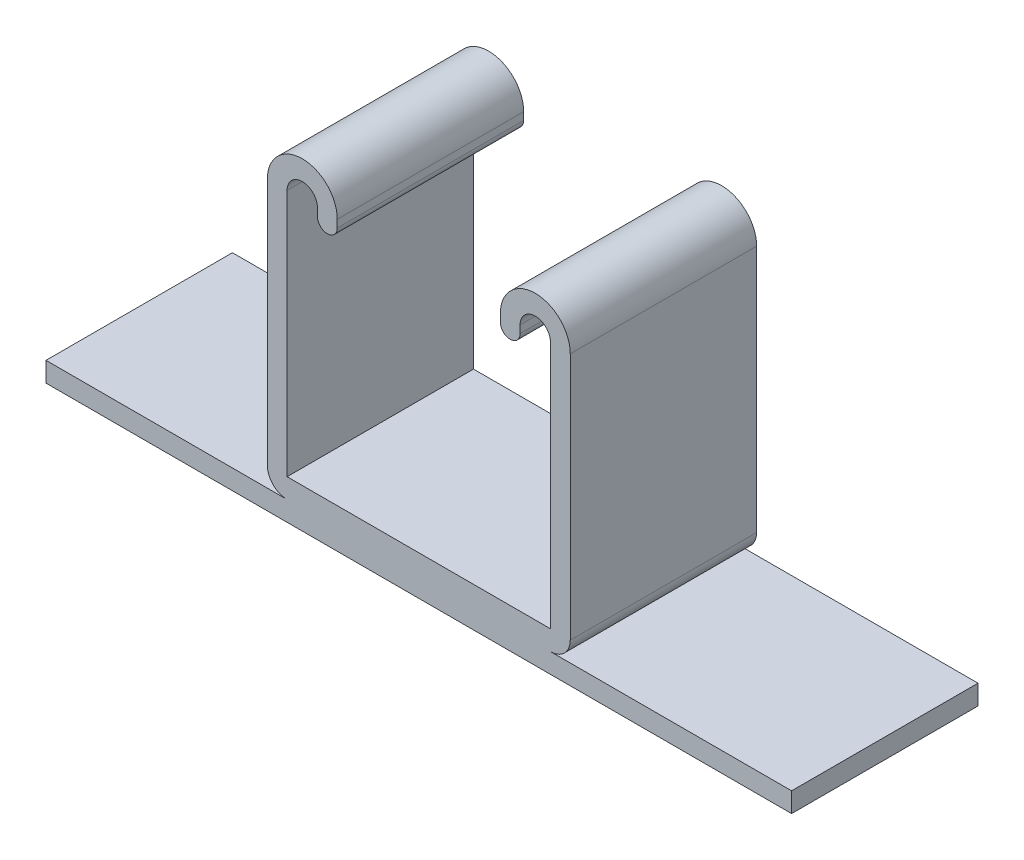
ISO-10303-21;
HEADER;
FILE_DESCRIPTION(('STEP AP214'),'2;1');
FILE_NAME('part.step','',(''),(''),'','','');
FILE_SCHEMA(('AUTOMOTIVE_DESIGN { 1 0 10303 214 1 1 1 1 }'));
ENDSEC;
DATA;
#1=APPLICATION_CONTEXT('core data for automotive mechanical design processes');
#2=APPLICATION_PROTOCOL_DEFINITION('international standard','automotive_design',2000,#1);
#3=PRODUCT_CONTEXT('',#1,'mechanical');
#4=PRODUCT('Part','Part','',(#3));
#5=PRODUCT_RELATED_PRODUCT_CATEGORY('part','',(#4));
#6=PRODUCT_DEFINITION_FORMATION('','',#4);
#7=PRODUCT_DEFINITION_CONTEXT('part definition',#1,'design');
#8=PRODUCT_DEFINITION('design','',#6,#7);
#9=PRODUCT_DEFINITION_SHAPE('','',#8);
#10=(LENGTH_UNIT() NAMED_UNIT(*) SI_UNIT(.MILLI.,.METRE.));
#11=(NAMED_UNIT(*) PLANE_ANGLE_UNIT() SI_UNIT($,.RADIAN.));
#12=(NAMED_UNIT(*) SI_UNIT($,.STERADIAN.) SOLID_ANGLE_UNIT());
#13=UNCERTAINTY_MEASURE_WITH_UNIT(LENGTH_MEASURE(1.E-05),#10,'distance_accuracy_value','');
#14=(GEOMETRIC_REPRESENTATION_CONTEXT(3) GLOBAL_UNCERTAINTY_ASSIGNED_CONTEXT((#13)) GLOBAL_UNIT_ASSIGNED_CONTEXT((#10,
#11,#12)) REPRESENTATION_CONTEXT('',''));
#15=CARTESIAN_POINT('',(0.,0.,0.));
#16=DIRECTION('',(0.,0.,1.));
#17=DIRECTION('',(1.,0.,0.));
#18=AXIS2_PLACEMENT_3D('',#15,#16,#17);
#19=CARTESIAN_POINT('',(-15.875,26.8351,12.7));
#20=DIRECTION('',(0.,0.,-1.));
#21=DIRECTION('',(-1.,0.,0.));
#22=AXIS2_PLACEMENT_3D('',#19,#20,#21);
#23=CYLINDRICAL_SURFACE('',#22,4.7625);
#24=CARTESIAN_POINT('',(-15.875,26.8351,-12.7));
#25=DIRECTION('',(0.,0.,1.));
#26=DIRECTION('',(-1.,0.,0.));
#27=AXIS2_PLACEMENT_3D('',#24,#25,#26);
#28=CIRCLE('',#27,4.7625);
#29=CARTESIAN_POINT('',(-11.1125,26.8351,-12.7));
#30=VERTEX_POINT('',#29);
#31=CARTESIAN_POINT('',(-20.6375,26.8351,-12.7));
#32=VERTEX_POINT('',#31);
#33=EDGE_CURVE('E219',#30,#32,#28,.T.);
#34=ORIENTED_EDGE('',*,*,#33,.T.);
#35=DIRECTION('',(0.,0.,-1.));
#36=VECTOR('',#35,1.);
#37=CARTESIAN_POINT('',(-20.6375,26.8351,12.7));
#38=LINE('',#37,#36);
#39=CARTESIAN_POINT('',(-20.6375,26.8351,12.7));
#40=VERTEX_POINT('',#39);
#41=EDGE_CURVE('E11',#40,#32,#38,.T.);
#42=ORIENTED_EDGE('',*,*,#41,.F.);
#43=CARTESIAN_POINT('',(-15.875,26.8351,12.7));
#44=DIRECTION('',(0.,0.,1.));
#45=DIRECTION('',(-1.,0.,0.));
#46=AXIS2_PLACEMENT_3D('',#43,#44,#45);
#47=CIRCLE('',#46,4.7625);
#48=CARTESIAN_POINT('',(-11.1125,26.8351,12.7));
#49=VERTEX_POINT('',#48);
#50=EDGE_CURVE('E261',#49,#40,#47,.T.);
#51=ORIENTED_EDGE('',*,*,#50,.F.);
#52=DIRECTION('',(0.,0.,-1.));
#53=VECTOR('',#52,1.);
#54=CARTESIAN_POINT('',(-11.1125,26.8351,12.7));
#55=LINE('',#54,#53);
#56=EDGE_CURVE('E215',#49,#30,#55,.T.);
#57=ORIENTED_EDGE('',*,*,#56,.T.);
#58=EDGE_LOOP('',(#34,#42,#51,#57));
#59=FACE_BOUND('',#58,.T.);
#60=ADVANCED_FACE('F39',(#59),#23,.T.);
#61=CARTESIAN_POINT('',(-20.6375,26.8351,12.7));
#62=DIRECTION('',(1.,0.,0.));
#63=DIRECTION('',(0.,0.,-1.));
#64=AXIS2_PLACEMENT_3D('',#61,#62,#63);
#65=PLANE('',#64);
#66=DIRECTION('',(0.,-1.,0.));
#67=VECTOR('',#66,1.);
#68=CARTESIAN_POINT('',(-20.6375,26.8351,-12.7));
#69=LINE('',#68,#67);
#70=CARTESIAN_POINT('',(-20.6375,-6.95960000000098,-12.7));
#71=VERTEX_POINT('',#70);
#72=EDGE_CURVE('E222',#32,#71,#69,.T.);
#73=ORIENTED_EDGE('',*,*,#72,.T.);
#74=DIRECTION('',(0.,0.,-1.));
#75=VECTOR('',#74,1.);
#76=CARTESIAN_POINT('',(-20.6375,-6.95960000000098,12.7));
#77=LINE('',#76,#75);
#78=CARTESIAN_POINT('',(-20.6375,-6.95960000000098,12.7));
#79=VERTEX_POINT('',#78);
#80=EDGE_CURVE('E47',#79,#71,#77,.T.);
#81=ORIENTED_EDGE('',*,*,#80,.F.);
#82=DIRECTION('',(0.,-1.,0.));
#83=VECTOR('',#82,1.);
#84=CARTESIAN_POINT('',(-20.6375,26.8351,12.7));
#85=LINE('',#84,#83);
#86=EDGE_CURVE('E140',#40,#79,#85,.T.);
#87=ORIENTED_EDGE('',*,*,#86,.F.);
#88=ORIENTED_EDGE('',*,*,#41,.T.);
#89=EDGE_LOOP('',(#73,#81,#87,#88));
#90=FACE_BOUND('',#89,.T.);
#91=ADVANCED_FACE('F389',(#90),#65,.F.);
#92=CARTESIAN_POINT('',(-17.9451,-6.95960000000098,12.7));
#93=DIRECTION('',(0.,0.,-1.));
#94=DIRECTION('',(-1.,0.,0.));
#95=AXIS2_PLACEMENT_3D('',#92,#93,#94);
#96=CYLINDRICAL_SURFACE('',#95,2.69239999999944);
#97=CARTESIAN_POINT('',(-17.9451,-6.95960000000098,-12.7));
#98=DIRECTION('',(0.,0.,1.));
#99=DIRECTION('',(-1.,0.,0.));
#100=AXIS2_PLACEMENT_3D('',#97,#98,#99);
#101=CIRCLE('',#100,2.69239999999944);
#102=CARTESIAN_POINT('',(-17.9451,-9.65200000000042,-12.7));
#103=VERTEX_POINT('',#102);
#104=EDGE_CURVE('E224',#71,#103,#101,.T.);
#105=ORIENTED_EDGE('',*,*,#104,.T.);
#106=DIRECTION('',(0.,0.,-1.));
#107=VECTOR('',#106,1.);
#108=CARTESIAN_POINT('',(-17.9451,-9.65200000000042,12.7));
#109=LINE('',#108,#107);
#110=CARTESIAN_POINT('',(-17.9451,-9.65200000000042,12.7));
#111=VERTEX_POINT('',#110);
#112=EDGE_CURVE('E310',#111,#103,#109,.T.);
#113=ORIENTED_EDGE('',*,*,#112,.F.);
#114=CARTESIAN_POINT('',(-17.9451,-6.95960000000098,12.7));
#115=DIRECTION('',(0.,0.,1.));
#116=DIRECTION('',(-1.,0.,0.));
#117=AXIS2_PLACEMENT_3D('',#114,#115,#116);
#118=CIRCLE('',#117,2.69239999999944);
#119=EDGE_CURVE('E318',#79,#111,#118,.T.);
#120=ORIENTED_EDGE('',*,*,#119,.F.);
#121=ORIENTED_EDGE('',*,*,#80,.T.);
#122=EDGE_LOOP('',(#105,#113,#120,#121));
#123=FACE_BOUND('',#122,.T.);
#124=ADVANCED_FACE('F316',(#123),#96,.T.);
#125=CARTESIAN_POINT('',(-50.8,-9.65200000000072,12.7));
#126=DIRECTION('',(0.,-1.,0.));
#127=DIRECTION('',(1.,0.,0.));
#128=AXIS2_PLACEMENT_3D('',#125,#126,#127);
#129=PLANE('',#128);
#130=DIRECTION('',(-1.,0.,0.));
#131=VECTOR('',#130,1.);
#132=CARTESIAN_POINT('',(-50.8,-9.65200000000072,-12.7));
#133=LINE('',#132,#131);
#134=CARTESIAN_POINT('',(-50.8,-9.65200000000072,-12.7));
#135=VERTEX_POINT('',#134);
#136=EDGE_CURVE('E226',#103,#135,#133,.T.);
#137=ORIENTED_EDGE('',*,*,#136,.T.);
#138=DIRECTION('',(0.,0.,-1.));
#139=VECTOR('',#138,1.);
#140=CARTESIAN_POINT('',(-50.8,-9.65200000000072,12.7));
#141=LINE('',#140,#139);
#142=CARTESIAN_POINT('',(-50.8,-9.65200000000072,12.7));
#143=VERTEX_POINT('',#142);
#144=EDGE_CURVE('E307',#143,#135,#141,.T.);
#145=ORIENTED_EDGE('',*,*,#144,.F.);
#146=DIRECTION('',(-1.,0.,0.));
#147=VECTOR('',#146,1.);
#148=CARTESIAN_POINT('',(-50.8,-9.65200000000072,12.7));
#149=LINE('',#148,#147);
#150=EDGE_CURVE('E336',#111,#143,#149,.T.);
#151=ORIENTED_EDGE('',*,*,#150,.F.);
#152=ORIENTED_EDGE('',*,*,#112,.T.);
#153=EDGE_LOOP('',(#137,#145,#151,#152));
#154=FACE_BOUND('',#153,.T.);
#155=ADVANCED_FACE('F327',(#154),#129,.F.);
#156=CARTESIAN_POINT('',(-50.8,-12.3444000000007,12.7));
#157=DIRECTION('',(1.,0.,0.));
#158=DIRECTION('',(0.,1.,0.));
#159=AXIS2_PLACEMENT_3D('',#156,#157,#158);
#160=PLANE('',#159);
#161=DIRECTION('',(0.,-1.,0.));
#162=VECTOR('',#161,1.);
#163=CARTESIAN_POINT('',(-50.8,-12.3444000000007,-12.7));
#164=LINE('',#163,#162);
#165=CARTESIAN_POINT('',(-50.8,-12.3444000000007,-12.7));
#166=VERTEX_POINT('',#165);
#167=EDGE_CURVE('E228',#135,#166,#164,.T.);
#168=ORIENTED_EDGE('',*,*,#167,.T.);
#169=DIRECTION('',(0.,0.,-1.));
#170=VECTOR('',#169,1.);
#171=CARTESIAN_POINT('',(-50.8,-12.3444000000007,12.7));
#172=LINE('',#171,#170);
#173=CARTESIAN_POINT('',(-50.8,-12.3444000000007,12.7));
#174=VERTEX_POINT('',#173);
#175=EDGE_CURVE('E304',#174,#166,#172,.T.);
#176=ORIENTED_EDGE('',*,*,#175,.F.);
#177=DIRECTION('',(0.,-1.,0.));
#178=VECTOR('',#177,1.);
#179=CARTESIAN_POINT('',(-50.8,-12.3444000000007,12.7));
#180=LINE('',#179,#178);
#181=EDGE_CURVE('E333',#143,#174,#180,.T.);
#182=ORIENTED_EDGE('',*,*,#181,.F.);
#183=ORIENTED_EDGE('',*,*,#144,.T.);
#184=EDGE_LOOP('',(#168,#176,#182,#183));
#185=FACE_BOUND('',#184,.T.);
#186=ADVANCED_FACE('F331',(#185),#160,.F.);
#187=CARTESIAN_POINT('',(50.8,-12.3444000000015,12.7));
#188=DIRECTION('',(0.,1.,0.));
#189=DIRECTION('',(-1.,0.,0.));
#190=AXIS2_PLACEMENT_3D('',#187,#188,#189);
#191=PLANE('',#190);
#192=DIRECTION('',(1.,0.,0.));
#193=VECTOR('',#192,1.);
#194=CARTESIAN_POINT('',(50.8,-12.3444000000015,-12.7));
#195=LINE('',#194,#193);
#196=CARTESIAN_POINT('',(50.8,-12.3444000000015,-12.7));
#197=VERTEX_POINT('',#196);
#198=EDGE_CURVE('E230',#166,#197,#195,.T.);
#199=ORIENTED_EDGE('',*,*,#198,.T.);
#200=DIRECTION('',(0.,0.,-1.));
#201=VECTOR('',#200,1.);
#202=CARTESIAN_POINT('',(50.8,-12.3444000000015,12.7));
#203=LINE('',#202,#201);
#204=CARTESIAN_POINT('',(50.8,-12.3444000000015,12.7));
#205=VERTEX_POINT('',#204);
#206=EDGE_CURVE('E301',#205,#197,#203,.T.);
#207=ORIENTED_EDGE('',*,*,#206,.F.);
#208=DIRECTION('',(1.,0.,0.));
#209=VECTOR('',#208,1.);
#210=CARTESIAN_POINT('',(50.8,-12.3444000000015,12.7));
#211=LINE('',#210,#209);
#212=EDGE_CURVE('E335',#174,#205,#211,.T.);
#213=ORIENTED_EDGE('',*,*,#212,.F.);
#214=ORIENTED_EDGE('',*,*,#175,.T.);
#215=EDGE_LOOP('',(#199,#207,#213,#214));
#216=FACE_BOUND('',#215,.T.);
#217=ADVANCED_FACE('F402',(#216),#191,.F.);
#218=CARTESIAN_POINT('',(50.8,-9.65200000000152,12.7));
#219=DIRECTION('',(-1.,0.,0.));
#220=DIRECTION('',(0.,0.,1.));
#221=AXIS2_PLACEMENT_3D('',#218,#219,#220);
#222=PLANE('',#221);
#223=DIRECTION('',(0.,1.,0.));
#224=VECTOR('',#223,1.);
#225=CARTESIAN_POINT('',(50.8,-9.65200000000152,-12.7));
#226=LINE('',#225,#224);
#227=CARTESIAN_POINT('',(50.8,-9.65200000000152,-12.7));
#228=VERTEX_POINT('',#227);
#229=EDGE_CURVE('E232',#197,#228,#226,.T.);
#230=ORIENTED_EDGE('',*,*,#229,.T.);
#231=DIRECTION('',(0.,0.,-1.));
#232=VECTOR('',#231,1.);
#233=CARTESIAN_POINT('',(50.8,-9.65200000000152,12.7));
#234=LINE('',#233,#232);
#235=CARTESIAN_POINT('',(50.8,-9.65200000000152,12.7));
#236=VERTEX_POINT('',#235);
#237=EDGE_CURVE('E298',#236,#228,#234,.T.);
#238=ORIENTED_EDGE('',*,*,#237,.F.);
#239=DIRECTION('',(0.,1.,0.));
#240=VECTOR('',#239,1.);
#241=CARTESIAN_POINT('',(50.8,-9.65200000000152,12.7));
#242=LINE('',#241,#240);
#243=EDGE_CURVE('E338',#205,#236,#242,.T.);
#244=ORIENTED_EDGE('',*,*,#243,.F.);
#245=ORIENTED_EDGE('',*,*,#206,.T.);
#246=EDGE_LOOP('',(#230,#238,#244,#245));
#247=FACE_BOUND('',#246,.T.);
#248=ADVANCED_FACE('F405',(#247),#222,.F.);
#249=CARTESIAN_POINT('',(17.9451,-9.65200000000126,12.7));
#250=DIRECTION('',(0.,-1.,0.));
#251=DIRECTION('',(1.,0.,0.));
#252=AXIS2_PLACEMENT_3D('',#249,#250,#251);
#253=PLANE('',#252);
#254=DIRECTION('',(-1.,0.,0.));
#255=VECTOR('',#254,1.);
#256=CARTESIAN_POINT('',(17.9451,-9.65200000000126,-12.7));
#257=LINE('',#256,#255);
#258=CARTESIAN_POINT('',(17.9451,-9.65200000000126,-12.7));
#259=VERTEX_POINT('',#258);
#260=EDGE_CURVE('E234',#228,#259,#257,.T.);
#261=ORIENTED_EDGE('',*,*,#260,.T.);
#262=DIRECTION('',(0.,0.,-1.));
#263=VECTOR('',#262,1.);
#264=CARTESIAN_POINT('',(17.9451,-9.65200000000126,12.7));
#265=LINE('',#264,#263);
#266=CARTESIAN_POINT('',(17.9451,-9.65200000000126,12.7));
#267=VERTEX_POINT('',#266);
#268=EDGE_CURVE('E295',#267,#259,#265,.T.);
#269=ORIENTED_EDGE('',*,*,#268,.F.);
#270=DIRECTION('',(-1.,0.,0.));
#271=VECTOR('',#270,1.);
#272=CARTESIAN_POINT('',(17.9451,-9.65200000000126,12.7));
#273=LINE('',#272,#271);
#274=EDGE_CURVE('E344',#236,#267,#273,.T.);
#275=ORIENTED_EDGE('',*,*,#274,.F.);
#276=ORIENTED_EDGE('',*,*,#237,.T.);
#277=EDGE_LOOP('',(#261,#269,#275,#276));
#278=FACE_BOUND('',#277,.T.);
#279=ADVANCED_FACE('F409',(#278),#253,.F.);
#280=CARTESIAN_POINT('',(17.9451,-6.95960000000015,12.7));
#281=DIRECTION('',(0.,0.,-1.));
#282=DIRECTION('',(-1.,0.,0.));
#283=AXIS2_PLACEMENT_3D('',#280,#281,#282);
#284=CYLINDRICAL_SURFACE('',#283,2.69240000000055);
#285=CARTESIAN_POINT('',(17.9451,-6.95960000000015,-12.7));
#286=DIRECTION('',(0.,0.,1.));
#287=DIRECTION('',(1.,0.,0.));
#288=AXIS2_PLACEMENT_3D('',#285,#286,#287);
#289=CIRCLE('',#288,2.69240000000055);
#290=CARTESIAN_POINT('',(20.6375000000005,-6.95960000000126,-12.7));
#291=VERTEX_POINT('',#290);
#292=EDGE_CURVE('E236',#259,#291,#289,.T.);
#293=ORIENTED_EDGE('',*,*,#292,.T.);
#294=DIRECTION('',(0.,0.,-1.));
#295=VECTOR('',#294,1.);
#296=CARTESIAN_POINT('',(20.6375000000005,-6.95960000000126,12.7));
#297=LINE('',#296,#295);
#298=CARTESIAN_POINT('',(20.6375000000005,-6.95960000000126,12.7));
#299=VERTEX_POINT('',#298);
#300=EDGE_CURVE('E292',#299,#291,#297,.T.);
#301=ORIENTED_EDGE('',*,*,#300,.F.);
#302=CARTESIAN_POINT('',(17.9451,-6.95960000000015,12.7));
#303=DIRECTION('',(0.,0.,1.));
#304=DIRECTION('',(1.,0.,0.));
#305=AXIS2_PLACEMENT_3D('',#302,#303,#304);
#306=CIRCLE('',#305,2.69240000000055);
#307=EDGE_CURVE('E346',#267,#299,#306,.T.);
#308=ORIENTED_EDGE('',*,*,#307,.F.);
#309=ORIENTED_EDGE('',*,*,#268,.T.);
#310=EDGE_LOOP('',(#293,#301,#308,#309));
#311=FACE_BOUND('',#310,.T.);
#312=ADVANCED_FACE('F413',(#311),#284,.T.);
#313=CARTESIAN_POINT('',(20.6375,-6.95960000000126,12.7));
#314=DIRECTION('',(-1.,0.,0.));
#315=DIRECTION('',(0.,-1.,0.));
#316=AXIS2_PLACEMENT_3D('',#313,#314,#315);
#317=PLANE('',#316);
#318=DIRECTION('',(0.,1.,0.));
#319=VECTOR('',#318,1.);
#320=CARTESIAN_POINT('',(20.6375,-6.95960000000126,-12.7));
#321=LINE('',#320,#319);
#322=CARTESIAN_POINT('',(20.6375,26.8351,-12.7));
#323=VERTEX_POINT('',#322);
#324=EDGE_CURVE('E238',#291,#323,#321,.T.);
#325=ORIENTED_EDGE('',*,*,#324,.T.);
#326=DIRECTION('',(0.,0.,-1.));
#327=VECTOR('',#326,1.);
#328=CARTESIAN_POINT('',(20.6375,26.8351,12.7));
#329=LINE('',#328,#327);
#330=CARTESIAN_POINT('',(20.6375,26.8351,12.7));
#331=VERTEX_POINT('',#330);
#332=EDGE_CURVE('E289',#331,#323,#329,.T.);
#333=ORIENTED_EDGE('',*,*,#332,.F.);
#334=DIRECTION('',(0.,1.,0.));
#335=VECTOR('',#334,1.);
#336=CARTESIAN_POINT('',(20.6375,-6.95960000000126,12.7));
#337=LINE('',#336,#335);
#338=EDGE_CURVE('E348',#299,#331,#337,.T.);
#339=ORIENTED_EDGE('',*,*,#338,.F.);
#340=ORIENTED_EDGE('',*,*,#300,.T.);
#341=EDGE_LOOP('',(#325,#333,#339,#340));
#342=FACE_BOUND('',#341,.T.);
#343=ADVANCED_FACE('F417',(#342),#317,.F.);
#344=CARTESIAN_POINT('',(15.875,26.8351,12.7));
#345=DIRECTION('',(0.,0.,-1.));
#346=DIRECTION('',(-1.,0.,0.));
#347=AXIS2_PLACEMENT_3D('',#344,#345,#346);
#348=CYLINDRICAL_SURFACE('',#347,4.7625);
#349=CARTESIAN_POINT('',(15.875,26.8351,-12.7));
#350=DIRECTION('',(0.,0.,1.));
#351=DIRECTION('',(1.,0.,0.));
#352=AXIS2_PLACEMENT_3D('',#349,#350,#351);
#353=CIRCLE('',#352,4.7625);
#354=CARTESIAN_POINT('',(11.1125,26.8351,-12.7));
#355=VERTEX_POINT('',#354);
#356=EDGE_CURVE('E240',#323,#355,#353,.T.);
#357=ORIENTED_EDGE('',*,*,#356,.T.);
#358=DIRECTION('',(0.,0.,-1.));
#359=VECTOR('',#358,1.);
#360=CARTESIAN_POINT('',(11.1125,26.8351,12.7));
#361=LINE('',#360,#359);
#362=CARTESIAN_POINT('',(11.1125,26.8351,12.7));
#363=VERTEX_POINT('',#362);
#364=EDGE_CURVE('E286',#363,#355,#361,.T.);
#365=ORIENTED_EDGE('',*,*,#364,.F.);
#366=CARTESIAN_POINT('',(15.875,26.8351,12.7));
#367=DIRECTION('',(0.,0.,1.));
#368=DIRECTION('',(1.,0.,0.));
#369=AXIS2_PLACEMENT_3D('',#366,#367,#368);
#370=CIRCLE('',#369,4.7625);
#371=EDGE_CURVE('E350',#331,#363,#370,.T.);
#372=ORIENTED_EDGE('',*,*,#371,.F.);
#373=ORIENTED_EDGE('',*,*,#332,.T.);
#374=EDGE_LOOP('',(#357,#365,#372,#373));
#375=FACE_BOUND('',#374,.T.);
#376=ADVANCED_FACE('F421',(#375),#348,.T.);
#377=CARTESIAN_POINT('',(11.1125,26.8351,12.7));
#378=DIRECTION('',(1.,0.,0.));
#379=DIRECTION('',(0.,1.,0.));
#380=AXIS2_PLACEMENT_3D('',#377,#378,#379);
#381=PLANE('',#380);
#382=DIRECTION('',(0.,-1.,0.));
#383=VECTOR('',#382,1.);
#384=CARTESIAN_POINT('',(11.1125,26.8351,-12.7));
#385=LINE('',#384,#383);
#386=CARTESIAN_POINT('',(11.1125,25.80005,-12.7));
#387=VERTEX_POINT('',#386);
#388=EDGE_CURVE('E242',#355,#387,#385,.T.);
#389=ORIENTED_EDGE('',*,*,#388,.T.);
#390=DIRECTION('',(0.,0.,-1.));
#391=VECTOR('',#390,1.);
#392=CARTESIAN_POINT('',(11.1125,25.80005,12.7));
#393=LINE('',#392,#391);
#394=CARTESIAN_POINT('',(11.1125,25.80005,12.7));
#395=VERTEX_POINT('',#394);
#396=EDGE_CURVE('E283',#395,#387,#393,.T.);
#397=ORIENTED_EDGE('',*,*,#396,.F.);
#398=DIRECTION('',(0.,-1.,0.));
#399=VECTOR('',#398,1.);
#400=CARTESIAN_POINT('',(11.1125,26.8351,12.7));
#401=LINE('',#400,#399);
#402=EDGE_CURVE('E352',#363,#395,#401,.T.);
#403=ORIENTED_EDGE('',*,*,#402,.F.);
#404=ORIENTED_EDGE('',*,*,#364,.T.);
#405=EDGE_LOOP('',(#389,#397,#403,#404));
#406=FACE_BOUND('',#405,.T.);
#407=ADVANCED_FACE('F425',(#406),#381,.F.);
#408=CARTESIAN_POINT('',(12.4587,25.80005,12.7));
#409=DIRECTION('',(0.,0.,-1.));
#410=DIRECTION('',(-1.,0.,0.));
#411=AXIS2_PLACEMENT_3D('',#408,#409,#410);
#412=CYLINDRICAL_SURFACE('',#411,1.3462);
#413=CARTESIAN_POINT('',(12.4587,25.80005,-12.7));
#414=DIRECTION('',(0.,0.,1.));
#415=DIRECTION('',(1.,0.,0.));
#416=AXIS2_PLACEMENT_3D('',#413,#414,#415);
#417=CIRCLE('',#416,1.3462);
#418=CARTESIAN_POINT('',(13.8049,25.80005,-12.7));
#419=VERTEX_POINT('',#418);
#420=EDGE_CURVE('E244',#387,#419,#417,.T.);
#421=ORIENTED_EDGE('',*,*,#420,.T.);
#422=DIRECTION('',(0.,0.,-1.));
#423=VECTOR('',#422,1.);
#424=CARTESIAN_POINT('',(13.8049,25.80005,12.7));
#425=LINE('',#424,#423);
#426=CARTESIAN_POINT('',(13.8049,25.80005,12.7));
#427=VERTEX_POINT('',#426);
#428=EDGE_CURVE('E280',#427,#419,#425,.T.);
#429=ORIENTED_EDGE('',*,*,#428,.F.);
#430=CARTESIAN_POINT('',(12.4587,25.80005,12.7));
#431=DIRECTION('',(0.,0.,1.));
#432=DIRECTION('',(1.,0.,0.));
#433=AXIS2_PLACEMENT_3D('',#430,#431,#432);
#434=CIRCLE('',#433,1.3462);
#435=EDGE_CURVE('E354',#395,#427,#434,.T.);
#436=ORIENTED_EDGE('',*,*,#435,.F.);
#437=ORIENTED_EDGE('',*,*,#396,.T.);
#438=EDGE_LOOP('',(#421,#429,#436,#437));
#439=FACE_BOUND('',#438,.T.);
#440=ADVANCED_FACE('F429',(#439),#412,.T.);
#441=CARTESIAN_POINT('',(13.8049,26.8351,12.7));
#442=DIRECTION('',(-1.,0.,0.));
#443=DIRECTION('',(0.,0.,1.));
#444=AXIS2_PLACEMENT_3D('',#441,#442,#443);
#445=PLANE('',#444);
#446=DIRECTION('',(0.,1.,0.));
#447=VECTOR('',#446,1.);
#448=CARTESIAN_POINT('',(13.8049,26.8351,-12.7));
#449=LINE('',#448,#447);
#450=CARTESIAN_POINT('',(13.8049,26.8351,-12.7));
#451=VERTEX_POINT('',#450);
#452=EDGE_CURVE('E246',#419,#451,#449,.T.);
#453=ORIENTED_EDGE('',*,*,#452,.T.);
#454=DIRECTION('',(0.,0.,-1.));
#455=VECTOR('',#454,1.);
#456=CARTESIAN_POINT('',(13.8049,26.8351,12.7));
#457=LINE('',#456,#455);
#458=CARTESIAN_POINT('',(13.8049,26.8351,12.7));
#459=VERTEX_POINT('',#458);
#460=EDGE_CURVE('E277',#459,#451,#457,.T.);
#461=ORIENTED_EDGE('',*,*,#460,.F.);
#462=DIRECTION('',(0.,1.,0.));
#463=VECTOR('',#462,1.);
#464=CARTESIAN_POINT('',(13.8049,26.8351,12.7));
#465=LINE('',#464,#463);
#466=EDGE_CURVE('E356',#427,#459,#465,.T.);
#467=ORIENTED_EDGE('',*,*,#466,.F.);
#468=ORIENTED_EDGE('',*,*,#428,.T.);
#469=EDGE_LOOP('',(#453,#461,#467,#468));
#470=FACE_BOUND('',#469,.T.);
#471=ADVANCED_FACE('F433',(#470),#445,.F.);
#472=CARTESIAN_POINT('',(15.875,26.8351,12.7));
#473=DIRECTION('',(0.,0.,-1.));
#474=DIRECTION('',(-1.,0.,0.));
#475=AXIS2_PLACEMENT_3D('',#472,#473,#474);
#476=CYLINDRICAL_SURFACE('',#475,2.0701);
#477=CARTESIAN_POINT('',(15.875,26.8351,-12.7));
#478=DIRECTION('',(0.,0.,-1.));
#479=DIRECTION('',(1.,0.,0.));
#480=AXIS2_PLACEMENT_3D('',#477,#478,#479);
#481=CIRCLE('',#480,2.0701);
#482=CARTESIAN_POINT('',(17.9451,26.8351,-12.7));
#483=VERTEX_POINT('',#482);
#484=EDGE_CURVE('E248',#451,#483,#481,.T.);
#485=ORIENTED_EDGE('',*,*,#484,.T.);
#486=DIRECTION('',(0.,0.,-1.));
#487=VECTOR('',#486,1.);
#488=CARTESIAN_POINT('',(17.9451,26.8351,12.7));
#489=LINE('',#488,#487);
#490=CARTESIAN_POINT('',(17.9451,26.8351,12.7));
#491=VERTEX_POINT('',#490);
#492=EDGE_CURVE('E274',#491,#483,#489,.T.);
#493=ORIENTED_EDGE('',*,*,#492,.F.);
#494=CARTESIAN_POINT('',(15.875,26.8351,12.7));
#495=DIRECTION('',(0.,0.,-1.));
#496=DIRECTION('',(1.,0.,0.));
#497=AXIS2_PLACEMENT_3D('',#494,#495,#496);
#498=CIRCLE('',#497,2.0701);
#499=EDGE_CURVE('E358',#459,#491,#498,.T.);
#500=ORIENTED_EDGE('',*,*,#499,.F.);
#501=ORIENTED_EDGE('',*,*,#460,.T.);
#502=EDGE_LOOP('',(#485,#493,#500,#501));
#503=FACE_BOUND('',#502,.T.);
#504=ADVANCED_FACE('F437',(#503),#476,.F.);
#505=CARTESIAN_POINT('',(17.9451,-6.95960000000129,12.7));
#506=DIRECTION('',(1.,0.,0.));
#507=DIRECTION('',(0.,1.,0.));
#508=AXIS2_PLACEMENT_3D('',#505,#506,#507);
#509=PLANE('',#508);
#510=DIRECTION('',(0.,-1.,0.));
#511=VECTOR('',#510,1.);
#512=CARTESIAN_POINT('',(17.9451,-6.95960000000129,-12.7));
#513=LINE('',#512,#511);
#514=CARTESIAN_POINT('',(17.9451,-6.95960000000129,-12.7));
#515=VERTEX_POINT('',#514);
#516=EDGE_CURVE('E250',#483,#515,#513,.T.);
#517=ORIENTED_EDGE('',*,*,#516,.T.);
#518=DIRECTION('',(0.,0.,-1.));
#519=VECTOR('',#518,1.);
#520=CARTESIAN_POINT('',(17.9451,-6.95960000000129,12.7));
#521=LINE('',#520,#519);
#522=CARTESIAN_POINT('',(17.9451,-6.95960000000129,12.7));
#523=VERTEX_POINT('',#522);
#524=EDGE_CURVE('E271',#523,#515,#521,.T.);
#525=ORIENTED_EDGE('',*,*,#524,.F.);
#526=DIRECTION('',(0.,-1.,0.));
#527=VECTOR('',#526,1.);
#528=CARTESIAN_POINT('',(17.9451,-6.95960000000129,12.7));
#529=LINE('',#528,#527);
#530=EDGE_CURVE('E360',#491,#523,#529,.T.);
#531=ORIENTED_EDGE('',*,*,#530,.F.);
#532=ORIENTED_EDGE('',*,*,#492,.T.);
#533=EDGE_LOOP('',(#517,#525,#531,#532));
#534=FACE_BOUND('',#533,.T.);
#535=ADVANCED_FACE('F441',(#534),#509,.F.);
#536=CARTESIAN_POINT('',(-17.9451,-6.95960000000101,12.7));
#537=DIRECTION('',(0.,-1.,0.));
#538=DIRECTION('',(1.,0.,0.));
#539=AXIS2_PLACEMENT_3D('',#536,#537,#538);
#540=PLANE('',#539);
#541=DIRECTION('',(-1.,0.,0.));
#542=VECTOR('',#541,1.);
#543=CARTESIAN_POINT('',(-17.9451,-6.95960000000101,-12.7));
#544=LINE('',#543,#542);
#545=CARTESIAN_POINT('',(-17.9451,-6.95960000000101,-12.7));
#546=VERTEX_POINT('',#545);
#547=EDGE_CURVE('E252',#515,#546,#544,.T.);
#548=ORIENTED_EDGE('',*,*,#547,.T.);
#549=DIRECTION('',(0.,0.,-1.));
#550=VECTOR('',#549,1.);
#551=CARTESIAN_POINT('',(-17.9451,-6.95960000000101,12.7));
#552=LINE('',#551,#550);
#553=CARTESIAN_POINT('',(-17.9451,-6.95960000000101,12.7));
#554=VERTEX_POINT('',#553);
#555=EDGE_CURVE('E268',#554,#546,#552,.T.);
#556=ORIENTED_EDGE('',*,*,#555,.F.);
#557=DIRECTION('',(-1.,0.,0.));
#558=VECTOR('',#557,1.);
#559=CARTESIAN_POINT('',(-17.9451,-6.95960000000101,12.7));
#560=LINE('',#559,#558);
#561=EDGE_CURVE('E362',#523,#554,#560,.T.);
#562=ORIENTED_EDGE('',*,*,#561,.F.);
#563=ORIENTED_EDGE('',*,*,#524,.T.);
#564=EDGE_LOOP('',(#548,#556,#562,#563));
#565=FACE_BOUND('',#564,.T.);
#566=ADVANCED_FACE('F445',(#565),#540,.F.);
#567=CARTESIAN_POINT('',(-17.9451,26.8351,12.7));
#568=DIRECTION('',(-1.,0.,0.));
#569=DIRECTION('',(0.,-1.,0.));
#570=AXIS2_PLACEMENT_3D('',#567,#568,#569);
#571=PLANE('',#570);
#572=DIRECTION('',(0.,1.,0.));
#573=VECTOR('',#572,1.);
#574=CARTESIAN_POINT('',(-17.9451,26.8351,-12.7));
#575=LINE('',#574,#573);
#576=CARTESIAN_POINT('',(-17.9451,26.8351,-12.7));
#577=VERTEX_POINT('',#576);
#578=EDGE_CURVE('E254',#546,#577,#575,.T.);
#579=ORIENTED_EDGE('',*,*,#578,.T.);
#580=DIRECTION('',(0.,0.,-1.));
#581=VECTOR('',#580,1.);
#582=CARTESIAN_POINT('',(-17.9451,26.8351,12.7));
#583=LINE('',#582,#581);
#584=CARTESIAN_POINT('',(-17.9451,26.8351,12.7));
#585=VERTEX_POINT('',#584);
#586=EDGE_CURVE('E265',#585,#577,#583,.T.);
#587=ORIENTED_EDGE('',*,*,#586,.F.);
#588=DIRECTION('',(0.,1.,0.));
#589=VECTOR('',#588,1.);
#590=CARTESIAN_POINT('',(-17.9451,26.8351,12.7));
#591=LINE('',#590,#589);
#592=EDGE_CURVE('E364',#554,#585,#591,.T.);
#593=ORIENTED_EDGE('',*,*,#592,.F.);
#594=ORIENTED_EDGE('',*,*,#555,.T.);
#595=EDGE_LOOP('',(#579,#587,#593,#594));
#596=FACE_BOUND('',#595,.T.);
#597=ADVANCED_FACE('F370',(#596),#571,.F.);
#598=CARTESIAN_POINT('',(-15.875,26.8351,12.7));
#599=DIRECTION('',(0.,0.,-1.));
#600=DIRECTION('',(-1.,0.,0.));
#601=AXIS2_PLACEMENT_3D('',#598,#599,#600);
#602=CYLINDRICAL_SURFACE('',#601,2.0701);
#603=CARTESIAN_POINT('',(-15.875,26.8351,-12.7));
#604=DIRECTION('',(0.,0.,-1.));
#605=DIRECTION('',(-1.,0.,0.));
#606=AXIS2_PLACEMENT_3D('',#603,#604,#605);
#607=CIRCLE('',#606,2.0701);
#608=CARTESIAN_POINT('',(-13.8049,26.8351,-12.7));
#609=VERTEX_POINT('',#608);
#610=EDGE_CURVE('E256',#577,#609,#607,.T.);
#611=ORIENTED_EDGE('',*,*,#610,.T.);
#612=DIRECTION('',(0.,0.,-1.));
#613=VECTOR('',#612,1.);
#614=CARTESIAN_POINT('',(-13.8049,26.8351,12.7));
#615=LINE('',#614,#613);
#616=CARTESIAN_POINT('',(-13.8049,26.8351,12.7));
#617=VERTEX_POINT('',#616);
#618=EDGE_CURVE('E210',#617,#609,#615,.T.);
#619=ORIENTED_EDGE('',*,*,#618,.F.);
#620=CARTESIAN_POINT('',(-15.875,26.8351,12.7));
#621=DIRECTION('',(0.,0.,-1.));
#622=DIRECTION('',(-1.,0.,0.));
#623=AXIS2_PLACEMENT_3D('',#620,#621,#622);
#624=CIRCLE('',#623,2.0701);
#625=EDGE_CURVE('E201',#585,#617,#624,.T.);
#626=ORIENTED_EDGE('',*,*,#625,.F.);
#627=ORIENTED_EDGE('',*,*,#586,.T.);
#628=EDGE_LOOP('',(#611,#619,#626,#627));
#629=FACE_BOUND('',#628,.T.);
#630=ADVANCED_FACE('F374',(#629),#602,.F.);
#631=CARTESIAN_POINT('',(-13.8049,26.8351,12.7));
#632=DIRECTION('',(1.,0.,0.));
#633=DIRECTION('',(0.,1.,0.));
#634=AXIS2_PLACEMENT_3D('',#631,#632,#633);
#635=PLANE('',#634);
#636=DIRECTION('',(0.,-1.,0.));
#637=VECTOR('',#636,1.);
#638=CARTESIAN_POINT('',(-13.8049,26.8351,-12.7));
#639=LINE('',#638,#637);
#640=CARTESIAN_POINT('',(-13.8049,25.80005,-12.7));
#641=VERTEX_POINT('',#640);
#642=EDGE_CURVE('E209',#609,#641,#639,.T.);
#643=ORIENTED_EDGE('',*,*,#642,.T.);
#644=DIRECTION('',(0.,0.,-1.));
#645=VECTOR('',#644,1.);
#646=CARTESIAN_POINT('',(-13.8049,25.80005,12.7));
#647=LINE('',#646,#645);
#648=CARTESIAN_POINT('',(-13.8049,25.80005,12.7));
#649=VERTEX_POINT('',#648);
#650=EDGE_CURVE('E206',#649,#641,#647,.T.);
#651=ORIENTED_EDGE('',*,*,#650,.F.);
#652=DIRECTION('',(0.,-1.,0.));
#653=VECTOR('',#652,1.);
#654=CARTESIAN_POINT('',(-13.8049,26.8351,12.7));
#655=LINE('',#654,#653);
#656=EDGE_CURVE('E195',#617,#649,#655,.T.);
#657=ORIENTED_EDGE('',*,*,#656,.F.);
#658=ORIENTED_EDGE('',*,*,#618,.T.);
#659=EDGE_LOOP('',(#643,#651,#657,#658));
#660=FACE_BOUND('',#659,.T.);
#661=ADVANCED_FACE('F207',(#660),#635,.F.);
#662=CARTESIAN_POINT('',(-12.4587,25.80005,12.7));
#663=DIRECTION('',(0.,0.,-1.));
#664=DIRECTION('',(-1.,0.,0.));
#665=AXIS2_PLACEMENT_3D('',#662,#663,#664);
#666=CYLINDRICAL_SURFACE('',#665,1.3462);
#667=CARTESIAN_POINT('',(-12.4587,25.80005,-12.7));
#668=DIRECTION('',(0.,0.,1.));
#669=DIRECTION('',(-1.,0.,0.));
#670=AXIS2_PLACEMENT_3D('',#667,#668,#669);
#671=CIRCLE('',#670,1.3462);
#672=CARTESIAN_POINT('',(-11.1125,25.80005,-12.7));
#673=VERTEX_POINT('',#672);
#674=EDGE_CURVE('E126',#641,#673,#671,.T.);
#675=ORIENTED_EDGE('',*,*,#674,.T.);
#676=DIRECTION('',(0.,0.,-1.));
#677=VECTOR('',#676,1.);
#678=CARTESIAN_POINT('',(-11.1125,25.80005,12.7));
#679=LINE('',#678,#677);
#680=CARTESIAN_POINT('',(-11.1125,25.80005,12.7));
#681=VERTEX_POINT('',#680);
#682=EDGE_CURVE('E211',#681,#673,#679,.T.);
#683=ORIENTED_EDGE('',*,*,#682,.F.);
#684=CARTESIAN_POINT('',(-12.4587,25.80005,12.7));
#685=DIRECTION('',(0.,0.,1.));
#686=DIRECTION('',(-1.,0.,0.));
#687=AXIS2_PLACEMENT_3D('',#684,#685,#686);
#688=CIRCLE('',#687,1.3462);
#689=EDGE_CURVE('E199',#649,#681,#688,.T.);
#690=ORIENTED_EDGE('',*,*,#689,.F.);
#691=ORIENTED_EDGE('',*,*,#650,.T.);
#692=EDGE_LOOP('',(#675,#683,#690,#691));
#693=FACE_BOUND('',#692,.T.);
#694=ADVANCED_FACE('F213',(#693),#666,.T.);
#695=CARTESIAN_POINT('',(-11.1125,26.8351,12.7));
#696=DIRECTION('',(-1.,0.,0.));
#697=DIRECTION('',(0.,0.,1.));
#698=AXIS2_PLACEMENT_3D('',#695,#696,#697);
#699=PLANE('',#698);
#700=DIRECTION('',(0.,1.,0.));
#701=VECTOR('',#700,1.);
#702=CARTESIAN_POINT('',(-11.1125,26.8351,-12.7));
#703=LINE('',#702,#701);
#704=EDGE_CURVE('E132',#673,#30,#703,.T.);
#705=ORIENTED_EDGE('',*,*,#704,.T.);
#706=ORIENTED_EDGE('',*,*,#56,.F.);
#707=DIRECTION('',(0.,1.,0.));
#708=VECTOR('',#707,1.);
#709=CARTESIAN_POINT('',(-11.1125,26.8351,12.7));
#710=LINE('',#709,#708);
#711=EDGE_CURVE('E55',#681,#49,#710,.T.);
#712=ORIENTED_EDGE('',*,*,#711,.F.);
#713=ORIENTED_EDGE('',*,*,#682,.T.);
#714=EDGE_LOOP('',(#705,#706,#712,#713));
#715=FACE_BOUND('',#714,.T.);
#716=ADVANCED_FACE('F378',(#715),#699,.F.);
#717=CARTESIAN_POINT('',(-15.875,26.8351,12.7));
#718=DIRECTION('',(0.,0.,-1.));
#719=DIRECTION('',(-1.,0.,0.));
#720=AXIS2_PLACEMENT_3D('',#717,#718,#719);
#721=PLANE('',#720);
#722=ORIENTED_EDGE('',*,*,#50,.T.);
#723=ORIENTED_EDGE('',*,*,#86,.T.);
#724=ORIENTED_EDGE('',*,*,#119,.T.);
#725=ORIENTED_EDGE('',*,*,#150,.T.);
#726=ORIENTED_EDGE('',*,*,#181,.T.);
#727=ORIENTED_EDGE('',*,*,#212,.T.);
#728=ORIENTED_EDGE('',*,*,#243,.T.);
#729=ORIENTED_EDGE('',*,*,#274,.T.);
#730=ORIENTED_EDGE('',*,*,#307,.T.);
#731=ORIENTED_EDGE('',*,*,#338,.T.);
#732=ORIENTED_EDGE('',*,*,#371,.T.);
#733=ORIENTED_EDGE('',*,*,#402,.T.);
#734=ORIENTED_EDGE('',*,*,#435,.T.);
#735=ORIENTED_EDGE('',*,*,#466,.T.);
#736=ORIENTED_EDGE('',*,*,#499,.T.);
#737=ORIENTED_EDGE('',*,*,#530,.T.);
#738=ORIENTED_EDGE('',*,*,#561,.T.);
#739=ORIENTED_EDGE('',*,*,#592,.T.);
#740=ORIENTED_EDGE('',*,*,#625,.T.);
#741=ORIENTED_EDGE('',*,*,#656,.T.);
#742=ORIENTED_EDGE('',*,*,#689,.T.);
#743=ORIENTED_EDGE('',*,*,#711,.T.);
#744=EDGE_LOOP('',(#722,#723,#724,#725,#726,#727,#728,#729,#730,#731,#732,#733,#734,#735,#736,
#737,#738,#739,#740,#741,#742,#743));
#745=FACE_BOUND('',#744,.T.);
#746=ADVANCED_FACE('F197',(#745),#721,.F.);
#747=CARTESIAN_POINT('',(-15.875,26.8351,-12.7));
#748=DIRECTION('',(0.,0.,-1.));
#749=DIRECTION('',(-1.,0.,0.));
#750=AXIS2_PLACEMENT_3D('',#747,#748,#749);
#751=PLANE('',#750);
#752=ORIENTED_EDGE('',*,*,#33,.F.);
#753=ORIENTED_EDGE('',*,*,#704,.F.);
#754=ORIENTED_EDGE('',*,*,#674,.F.);
#755=ORIENTED_EDGE('',*,*,#642,.F.);
#756=ORIENTED_EDGE('',*,*,#610,.F.);
#757=ORIENTED_EDGE('',*,*,#578,.F.);
#758=ORIENTED_EDGE('',*,*,#547,.F.);
#759=ORIENTED_EDGE('',*,*,#516,.F.);
#760=ORIENTED_EDGE('',*,*,#484,.F.);
#761=ORIENTED_EDGE('',*,*,#452,.F.);
#762=ORIENTED_EDGE('',*,*,#420,.F.);
#763=ORIENTED_EDGE('',*,*,#388,.F.);
#764=ORIENTED_EDGE('',*,*,#356,.F.);
#765=ORIENTED_EDGE('',*,*,#324,.F.);
#766=ORIENTED_EDGE('',*,*,#292,.F.);
#767=ORIENTED_EDGE('',*,*,#260,.F.);
#768=ORIENTED_EDGE('',*,*,#229,.F.);
#769=ORIENTED_EDGE('',*,*,#198,.F.);
#770=ORIENTED_EDGE('',*,*,#167,.F.);
#771=ORIENTED_EDGE('',*,*,#136,.F.);
#772=ORIENTED_EDGE('',*,*,#104,.F.);
#773=ORIENTED_EDGE('',*,*,#72,.F.);
#774=EDGE_LOOP('',(#752,#753,#754,#755,#756,#757,#758,#759,#760,#761,#762,#763,#764,#765,#766,
#767,#768,#769,#770,#771,#772,#773));
#775=FACE_BOUND('',#774,.T.);
#776=ADVANCED_FACE('F322',(#775),#751,.T.);
#777=CLOSED_SHELL('',(#60,#91,#124,#155,#186,#217,#248,#279,#312,#343,#376,#407,#440,#471,#504,
#535,#566,#597,#630,#661,#694,#716,#746,#776));
#778=MANIFOLD_SOLID_BREP('B2',#777);
#779=ADVANCED_BREP_SHAPE_REPRESENTATION('',(#18,#778),#14);
#780=SHAPE_DEFINITION_REPRESENTATION(#9,#779);
ENDSEC;
END-ISO-10303-21;
